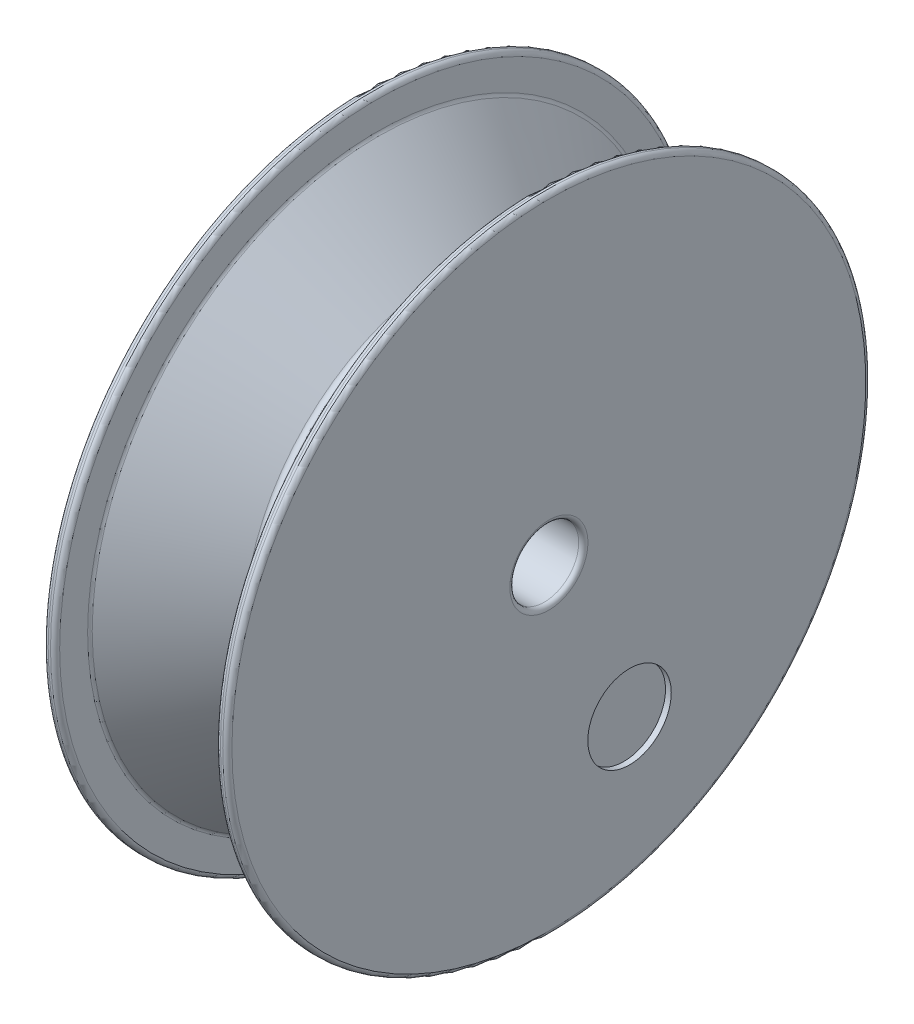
ISO-10303-21;
HEADER;
FILE_DESCRIPTION(('STEP AP214'),'2;1');
FILE_NAME('part.step','',(''),(''),'','','');
FILE_SCHEMA(('AUTOMOTIVE_DESIGN { 1 0 10303 214 1 1 1 1 }'));
ENDSEC;
DATA;
#1=APPLICATION_CONTEXT('core data for automotive mechanical design processes');
#2=APPLICATION_PROTOCOL_DEFINITION('international standard','automotive_design',2000,#1);
#3=PRODUCT_CONTEXT('',#1,'mechanical');
#4=PRODUCT('Part','Part','',(#3));
#5=PRODUCT_RELATED_PRODUCT_CATEGORY('part','',(#4));
#6=PRODUCT_DEFINITION_FORMATION('','',#4);
#7=PRODUCT_DEFINITION_CONTEXT('part definition',#1,'design');
#8=PRODUCT_DEFINITION('design','',#6,#7);
#9=PRODUCT_DEFINITION_SHAPE('','',#8);
#10=(LENGTH_UNIT() NAMED_UNIT(*) SI_UNIT(.MILLI.,.METRE.));
#11=(NAMED_UNIT(*) PLANE_ANGLE_UNIT() SI_UNIT($,.RADIAN.));
#12=(NAMED_UNIT(*) SI_UNIT($,.STERADIAN.) SOLID_ANGLE_UNIT());
#13=UNCERTAINTY_MEASURE_WITH_UNIT(LENGTH_MEASURE(1.E-05),#10,'distance_accuracy_value','');
#14=(GEOMETRIC_REPRESENTATION_CONTEXT(3) GLOBAL_UNCERTAINTY_ASSIGNED_CONTEXT((#13)) GLOBAL_UNIT_ASSIGNED_CONTEXT((#10,
#11,#12)) REPRESENTATION_CONTEXT('',''));
#15=CARTESIAN_POINT('',(0.,0.,0.));
#16=DIRECTION('',(0.,0.,1.));
#17=DIRECTION('',(1.,0.,0.));
#18=AXIS2_PLACEMENT_3D('',#15,#16,#17);
#19=CARTESIAN_POINT('',(0.,0.,0.));
#20=DIRECTION('',(-1.,0.,0.));
#21=DIRECTION('',(0.,0.,1.));
#22=AXIS2_PLACEMENT_3D('',#19,#20,#21);
#23=CYLINDRICAL_SURFACE('',#22,1.5);
#24=CARTESIAN_POINT('',(3.8,0.,0.));
#25=DIRECTION('',(-1.,0.,0.));
#26=DIRECTION('',(0.,0.,1.));
#27=AXIS2_PLACEMENT_3D('',#24,#25,#26);
#28=CIRCLE('',#27,1.5);
#29=CARTESIAN_POINT('',(3.8,0.,1.5));
#30=VERTEX_POINT('',#29);
#31=EDGE_CURVE('E40',#30,#30,#28,.F.);
#32=ORIENTED_EDGE('',*,*,#31,.T.);
#33=EDGE_LOOP('',(#32));
#34=FACE_BOUND('',#33,.T.);
#35=CARTESIAN_POINT('',(-3.8,0.,0.));
#36=DIRECTION('',(1.,0.,0.));
#37=DIRECTION('',(0.,0.,-1.));
#38=AXIS2_PLACEMENT_3D('',#35,#36,#37);
#39=CIRCLE('',#38,1.5);
#40=CARTESIAN_POINT('',(-3.8,0.,-1.5));
#41=VERTEX_POINT('',#40);
#42=EDGE_CURVE('E44',#41,#41,#39,.F.);
#43=ORIENTED_EDGE('',*,*,#42,.T.);
#44=EDGE_LOOP('',(#43));
#45=FACE_BOUND('',#44,.T.);
#46=ADVANCED_FACE('F29',(#34,#45),#23,.F.);
#47=CARTESIAN_POINT('',(-4.,1.5,0.));
#48=DIRECTION('',(1.,0.,0.));
#49=DIRECTION('',(0.,0.,-1.));
#50=AXIS2_PLACEMENT_3D('',#47,#48,#49);
#51=PLANE('',#50);
#52=CARTESIAN_POINT('',(-4.,0.,0.));
#53=DIRECTION('',(1.,0.,0.));
#54=DIRECTION('',(0.,0.,-1.));
#55=AXIS2_PLACEMENT_3D('',#52,#53,#54);
#56=CIRCLE('',#55,13.8);
#57=CARTESIAN_POINT('',(-4.,0.,-13.8));
#58=VERTEX_POINT('',#57);
#59=EDGE_CURVE('E10',#58,#58,#56,.F.);
#60=ORIENTED_EDGE('',*,*,#59,.T.);
#61=EDGE_LOOP('',(#60));
#62=FACE_BOUND('',#61,.T.);
#63=CARTESIAN_POINT('',(-4.,0.,0.));
#64=DIRECTION('',(1.,0.,0.));
#65=DIRECTION('',(0.,0.,-1.));
#66=AXIS2_PLACEMENT_3D('',#63,#64,#65);
#67=CIRCLE('',#66,1.7);
#68=CARTESIAN_POINT('',(-4.,0.,-1.7));
#69=VERTEX_POINT('',#68);
#70=EDGE_CURVE('E36',#69,#69,#67,.T.);
#71=ORIENTED_EDGE('',*,*,#70,.T.);
#72=EDGE_LOOP('',(#71));
#73=FACE_BOUND('',#72,.T.);
#74=ADVANCED_FACE('F135',(#62,#73),#51,.F.);
#75=CARTESIAN_POINT('',(0.,0.,0.));
#76=DIRECTION('',(-1.,0.,0.));
#77=DIRECTION('',(0.,0.,1.));
#78=AXIS2_PLACEMENT_3D('',#75,#76,#77);
#79=CYLINDRICAL_SURFACE('',#78,14.);
#80=CARTESIAN_POINT('',(-3.7,0.,0.));
#81=DIRECTION('',(-1.,0.,0.));
#82=DIRECTION('',(0.,0.,1.));
#83=AXIS2_PLACEMENT_3D('',#80,#81,#82);
#84=CIRCLE('',#83,14.);
#85=CARTESIAN_POINT('',(-3.7,0.,14.));
#86=VERTEX_POINT('',#85);
#87=EDGE_CURVE('E55',#86,#86,#84,.T.);
#88=ORIENTED_EDGE('',*,*,#87,.T.);
#89=EDGE_LOOP('',(#88));
#90=FACE_BOUND('',#89,.T.);
#91=CARTESIAN_POINT('',(-3.8,0.,0.));
#92=DIRECTION('',(1.,0.,0.));
#93=DIRECTION('',(0.,0.,-1.));
#94=AXIS2_PLACEMENT_3D('',#91,#92,#93);
#95=CIRCLE('',#94,14.);
#96=CARTESIAN_POINT('',(-3.8,0.,-14.));
#97=VERTEX_POINT('',#96);
#98=EDGE_CURVE('E58',#97,#97,#95,.T.);
#99=ORIENTED_EDGE('',*,*,#98,.T.);
#100=EDGE_LOOP('',(#99));
#101=FACE_BOUND('',#100,.T.);
#102=ADVANCED_FACE('F141',(#90,#101),#79,.T.);
#103=CARTESIAN_POINT('',(-3.5,14.,0.));
#104=DIRECTION('',(-1.,0.,0.));
#105=DIRECTION('',(0.,0.,1.));
#106=AXIS2_PLACEMENT_3D('',#103,#104,#105);
#107=PLANE('',#106);
#108=CARTESIAN_POINT('',(-3.5,0.,0.));
#109=DIRECTION('',(-1.,0.,0.));
#110=DIRECTION('',(0.,0.,1.));
#111=AXIS2_PLACEMENT_3D('',#108,#109,#110);
#112=CIRCLE('',#111,12.5828427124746);
#113=CARTESIAN_POINT('',(-3.5,0.,12.5828427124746));
#114=VERTEX_POINT('',#113);
#115=EDGE_CURVE('E61',#114,#114,#112,.T.);
#116=ORIENTED_EDGE('',*,*,#115,.T.);
#117=EDGE_LOOP('',(#116));
#118=FACE_BOUND('',#117,.T.);
#119=CARTESIAN_POINT('',(-3.5,0.,0.));
#120=DIRECTION('',(-1.,0.,0.));
#121=DIRECTION('',(0.,0.,1.));
#122=AXIS2_PLACEMENT_3D('',#119,#120,#121);
#123=CIRCLE('',#122,13.8);
#124=CARTESIAN_POINT('',(-3.5,0.,13.8));
#125=VERTEX_POINT('',#124);
#126=EDGE_CURVE('E64',#125,#125,#123,.F.);
#127=ORIENTED_EDGE('',*,*,#126,.T.);
#128=EDGE_LOOP('',(#127));
#129=FACE_BOUND('',#128,.T.);
#130=ADVANCED_FACE('F177',(#118,#129),#107,.F.);
#131=CARTESIAN_POINT('',(0.,0.,0.));
#132=DIRECTION('',(-1.,0.,0.));
#133=DIRECTION('',(0.,0.,1.));
#134=AXIS2_PLACEMENT_3D('',#131,#132,#133);
#135=CONICAL_SURFACE('',#134,8.99999999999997,0.785398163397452);
#136=CARTESIAN_POINT('',(-0.141421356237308,0.,0.));
#137=DIRECTION('',(-1.,0.,0.));
#138=DIRECTION('',(0.,0.,1.));
#139=AXIS2_PLACEMENT_3D('',#136,#137,#138);
#140=CIRCLE('',#139,9.14142135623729);
#141=CARTESIAN_POINT('',(-0.141421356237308,0.,9.14142135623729));
#142=VERTEX_POINT('',#141);
#143=EDGE_CURVE('E67',#142,#142,#140,.T.);
#144=ORIENTED_EDGE('',*,*,#143,.T.);
#145=EDGE_LOOP('',(#144));
#146=FACE_BOUND('',#145,.T.);
#147=CARTESIAN_POINT('',(-3.44142135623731,0.,0.));
#148=DIRECTION('',(-1.,0.,0.));
#149=DIRECTION('',(0.,0.,1.));
#150=AXIS2_PLACEMENT_3D('',#147,#148,#149);
#151=CIRCLE('',#150,12.4414213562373);
#152=CARTESIAN_POINT('',(-3.44142135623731,0.,12.4414213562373));
#153=VERTEX_POINT('',#152);
#154=EDGE_CURVE('E70',#153,#153,#151,.F.);
#155=ORIENTED_EDGE('',*,*,#154,.T.);
#156=EDGE_LOOP('',(#155));
#157=FACE_BOUND('',#156,.T.);
#158=ADVANCED_FACE('F182',(#146,#157),#135,.T.);
#159=CARTESIAN_POINT('',(3.5,0.,0.));
#160=DIRECTION('',(1.,0.,0.));
#161=DIRECTION('',(0.,0.,-1.));
#162=AXIS2_PLACEMENT_3D('',#159,#160,#161);
#163=CONICAL_SURFACE('',#162,12.5,0.785398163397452);
#164=CARTESIAN_POINT('',(3.4414213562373,0.,0.));
#165=DIRECTION('',(1.,0.,0.));
#166=DIRECTION('',(0.,0.,-1.));
#167=AXIS2_PLACEMENT_3D('',#164,#165,#166);
#168=CIRCLE('',#167,12.4414213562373);
#169=CARTESIAN_POINT('',(3.4414213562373,0.,-12.4414213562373));
#170=VERTEX_POINT('',#169);
#171=EDGE_CURVE('E73',#170,#170,#168,.F.);
#172=ORIENTED_EDGE('',*,*,#171,.T.);
#173=EDGE_LOOP('',(#172));
#174=FACE_BOUND('',#173,.T.);
#175=CARTESIAN_POINT('',(0.141421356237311,0.,0.));
#176=DIRECTION('',(1.,0.,0.));
#177=DIRECTION('',(0.,0.,-1.));
#178=AXIS2_PLACEMENT_3D('',#175,#176,#177);
#179=CIRCLE('',#178,9.14142135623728);
#180=CARTESIAN_POINT('',(0.141421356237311,0.,-9.14142135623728));
#181=VERTEX_POINT('',#180);
#182=EDGE_CURVE('E76',#181,#181,#179,.T.);
#183=ORIENTED_EDGE('',*,*,#182,.T.);
#184=EDGE_LOOP('',(#183));
#185=FACE_BOUND('',#184,.T.);
#186=ADVANCED_FACE('F131',(#174,#185),#163,.T.);
#187=CARTESIAN_POINT('',(3.49999999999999,12.5,0.));
#188=DIRECTION('',(1.,0.,0.));
#189=DIRECTION('',(0.,0.,-1.));
#190=AXIS2_PLACEMENT_3D('',#187,#188,#189);
#191=PLANE('',#190);
#192=CARTESIAN_POINT('',(3.49999999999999,0.,0.));
#193=DIRECTION('',(1.,0.,0.));
#194=DIRECTION('',(0.,0.,-1.));
#195=AXIS2_PLACEMENT_3D('',#192,#193,#194);
#196=CIRCLE('',#195,13.8);
#197=CARTESIAN_POINT('',(3.49999999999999,0.,-13.8));
#198=VERTEX_POINT('',#197);
#199=EDGE_CURVE('E85',#198,#198,#196,.F.);
#200=ORIENTED_EDGE('',*,*,#199,.T.);
#201=EDGE_LOOP('',(#200));
#202=FACE_BOUND('',#201,.T.);
#203=CARTESIAN_POINT('',(3.49999999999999,0.,0.));
#204=DIRECTION('',(1.,0.,0.));
#205=DIRECTION('',(0.,0.,-1.));
#206=AXIS2_PLACEMENT_3D('',#203,#204,#205);
#207=CIRCLE('',#206,12.5828427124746);
#208=CARTESIAN_POINT('',(3.49999999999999,0.,-12.5828427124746));
#209=VERTEX_POINT('',#208);
#210=EDGE_CURVE('E88',#209,#209,#207,.T.);
#211=ORIENTED_EDGE('',*,*,#210,.T.);
#212=EDGE_LOOP('',(#211));
#213=FACE_BOUND('',#212,.T.);
#214=ADVANCED_FACE('F125',(#202,#213),#191,.F.);
#215=CARTESIAN_POINT('',(0.,0.,0.));
#216=DIRECTION('',(-1.,0.,0.));
#217=DIRECTION('',(0.,0.,1.));
#218=AXIS2_PLACEMENT_3D('',#215,#216,#217);
#219=CYLINDRICAL_SURFACE('',#218,14.);
#220=CARTESIAN_POINT('',(3.69999999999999,0.,0.));
#221=DIRECTION('',(1.,0.,0.));
#222=DIRECTION('',(0.,0.,-1.));
#223=AXIS2_PLACEMENT_3D('',#220,#221,#222);
#224=CIRCLE('',#223,14.);
#225=CARTESIAN_POINT('',(3.69999999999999,0.,-14.));
#226=VERTEX_POINT('',#225);
#227=EDGE_CURVE('E79',#226,#226,#224,.T.);
#228=ORIENTED_EDGE('',*,*,#227,.T.);
#229=EDGE_LOOP('',(#228));
#230=FACE_BOUND('',#229,.T.);
#231=CARTESIAN_POINT('',(3.8,0.,0.));
#232=DIRECTION('',(-1.,0.,0.));
#233=DIRECTION('',(0.,0.,1.));
#234=AXIS2_PLACEMENT_3D('',#231,#232,#233);
#235=CIRCLE('',#234,14.);
#236=CARTESIAN_POINT('',(3.8,0.,14.));
#237=VERTEX_POINT('',#236);
#238=EDGE_CURVE('E82',#237,#237,#235,.T.);
#239=ORIENTED_EDGE('',*,*,#238,.T.);
#240=EDGE_LOOP('',(#239));
#241=FACE_BOUND('',#240,.T.);
#242=ADVANCED_FACE('F110',(#230,#241),#219,.T.);
#243=CARTESIAN_POINT('',(4.,1.5,0.));
#244=DIRECTION('',(-1.,0.,0.));
#245=DIRECTION('',(0.,0.,1.));
#246=AXIS2_PLACEMENT_3D('',#243,#244,#245);
#247=PLANE('',#246);
#248=CARTESIAN_POINT('',(4.,-7.47256814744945,-3.51192559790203));
#249=DIRECTION('',(1.,0.,0.));
#250=DIRECTION('',(0.,0.,-1.));
#251=AXIS2_PLACEMENT_3D('',#248,#249,#250);
#252=CIRCLE('',#251,1.81728081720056);
#253=CARTESIAN_POINT('',(4.,-7.47256814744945,-5.32920641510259));
#254=VERTEX_POINT('',#253);
#255=EDGE_CURVE('E92',#254,#254,#252,.T.);
#256=ORIENTED_EDGE('',*,*,#255,.F.);
#257=EDGE_LOOP('',(#256));
#258=FACE_BOUND('',#257,.T.);
#259=CARTESIAN_POINT('',(4.,0.,0.));
#260=DIRECTION('',(-1.,0.,0.));
#261=DIRECTION('',(0.,0.,1.));
#262=AXIS2_PLACEMENT_3D('',#259,#260,#261);
#263=CIRCLE('',#262,1.7);
#264=CARTESIAN_POINT('',(4.,0.,1.7));
#265=VERTEX_POINT('',#264);
#266=EDGE_CURVE('E49',#265,#265,#263,.T.);
#267=ORIENTED_EDGE('',*,*,#266,.T.);
#268=EDGE_LOOP('',(#267));
#269=FACE_BOUND('',#268,.T.);
#270=CARTESIAN_POINT('',(4.,0.,0.));
#271=DIRECTION('',(-1.,0.,0.));
#272=DIRECTION('',(0.,0.,1.));
#273=AXIS2_PLACEMENT_3D('',#270,#271,#272);
#274=CIRCLE('',#273,13.8);
#275=CARTESIAN_POINT('',(4.,0.,13.8));
#276=VERTEX_POINT('',#275);
#277=EDGE_CURVE('E52',#276,#276,#274,.F.);
#278=ORIENTED_EDGE('',*,*,#277,.T.);
#279=EDGE_LOOP('',(#278));
#280=FACE_BOUND('',#279,.T.);
#281=ADVANCED_FACE('F106',(#258,#269,#280),#247,.F.);
#282=CARTESIAN_POINT('',(3.69999999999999,0.,0.));
#283=DIRECTION('',(1.,0.,0.));
#284=DIRECTION('',(0.,0.,-1.));
#285=AXIS2_PLACEMENT_3D('',#282,#283,#284);
#286=TOROIDAL_SURFACE('',#285,13.8,0.2);
#287=ORIENTED_EDGE('',*,*,#227,.F.);
#288=EDGE_LOOP('',(#287));
#289=FACE_BOUND('',#288,.T.);
#290=ORIENTED_EDGE('',*,*,#199,.F.);
#291=EDGE_LOOP('',(#290));
#292=FACE_BOUND('',#291,.T.);
#293=ADVANCED_FACE('F109',(#289,#292),#286,.T.);
#294=CARTESIAN_POINT('',(3.29999999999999,0.,0.));
#295=DIRECTION('',(1.,0.,0.));
#296=DIRECTION('',(0.,0.,-1.));
#297=AXIS2_PLACEMENT_3D('',#294,#295,#296);
#298=TOROIDAL_SURFACE('',#297,12.5828427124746,0.2);
#299=ORIENTED_EDGE('',*,*,#210,.F.);
#300=EDGE_LOOP('',(#299));
#301=FACE_BOUND('',#300,.T.);
#302=ORIENTED_EDGE('',*,*,#171,.F.);
#303=EDGE_LOOP('',(#302));
#304=FACE_BOUND('',#303,.T.);
#305=ADVANCED_FACE('F148',(#301,#304),#298,.F.);
#306=CARTESIAN_POINT('',(0.,0.,0.));
#307=DIRECTION('',(-1.,0.,0.));
#308=DIRECTION('',(0.,0.,1.));
#309=AXIS2_PLACEMENT_3D('',#306,#307,#308);
#310=TOROIDAL_SURFACE('',#309,9.28284271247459,0.2);
#311=ORIENTED_EDGE('',*,*,#182,.F.);
#312=EDGE_LOOP('',(#311));
#313=FACE_BOUND('',#312,.T.);
#314=ORIENTED_EDGE('',*,*,#143,.F.);
#315=EDGE_LOOP('',(#314));
#316=FACE_BOUND('',#315,.T.);
#317=ADVANCED_FACE('F152',(#313,#316),#310,.F.);
#318=CARTESIAN_POINT('',(-3.3,0.,0.));
#319=DIRECTION('',(-1.,0.,0.));
#320=DIRECTION('',(0.,0.,1.));
#321=AXIS2_PLACEMENT_3D('',#318,#319,#320);
#322=TOROIDAL_SURFACE('',#321,12.5828427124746,0.2);
#323=ORIENTED_EDGE('',*,*,#154,.F.);
#324=EDGE_LOOP('',(#323));
#325=FACE_BOUND('',#324,.T.);
#326=ORIENTED_EDGE('',*,*,#115,.F.);
#327=EDGE_LOOP('',(#326));
#328=FACE_BOUND('',#327,.T.);
#329=ADVANCED_FACE('F156',(#325,#328),#322,.F.);
#330=CARTESIAN_POINT('',(-3.7,0.,0.));
#331=DIRECTION('',(-1.,0.,0.));
#332=DIRECTION('',(0.,0.,1.));
#333=AXIS2_PLACEMENT_3D('',#330,#331,#332);
#334=TOROIDAL_SURFACE('',#333,13.8,0.2);
#335=ORIENTED_EDGE('',*,*,#126,.F.);
#336=EDGE_LOOP('',(#335));
#337=FACE_BOUND('',#336,.T.);
#338=ORIENTED_EDGE('',*,*,#87,.F.);
#339=EDGE_LOOP('',(#338));
#340=FACE_BOUND('',#339,.T.);
#341=ADVANCED_FACE('F160',(#337,#340),#334,.T.);
#342=CARTESIAN_POINT('',(3.8,0.,0.));
#343=DIRECTION('',(-1.,0.,0.));
#344=DIRECTION('',(0.,0.,1.));
#345=AXIS2_PLACEMENT_3D('',#342,#343,#344);
#346=TOROIDAL_SURFACE('',#345,1.7,0.2);
#347=ORIENTED_EDGE('',*,*,#31,.F.);
#348=EDGE_LOOP('',(#347));
#349=FACE_BOUND('',#348,.T.);
#350=ORIENTED_EDGE('',*,*,#266,.F.);
#351=EDGE_LOOP('',(#350));
#352=FACE_BOUND('',#351,.T.);
#353=ADVANCED_FACE('F120',(#349,#352),#346,.T.);
#354=CARTESIAN_POINT('',(3.8,0.,0.));
#355=DIRECTION('',(-1.,0.,0.));
#356=DIRECTION('',(0.,0.,1.));
#357=AXIS2_PLACEMENT_3D('',#354,#355,#356);
#358=TOROIDAL_SURFACE('',#357,13.8,0.2);
#359=ORIENTED_EDGE('',*,*,#277,.F.);
#360=EDGE_LOOP('',(#359));
#361=FACE_BOUND('',#360,.T.);
#362=ORIENTED_EDGE('',*,*,#238,.F.);
#363=EDGE_LOOP('',(#362));
#364=FACE_BOUND('',#363,.T.);
#365=ADVANCED_FACE('F116',(#361,#364),#358,.T.);
#366=CARTESIAN_POINT('',(-3.8,0.,0.));
#367=DIRECTION('',(1.,0.,0.));
#368=DIRECTION('',(0.,0.,-1.));
#369=AXIS2_PLACEMENT_3D('',#366,#367,#368);
#370=TOROIDAL_SURFACE('',#369,13.8,0.2);
#371=ORIENTED_EDGE('',*,*,#98,.F.);
#372=EDGE_LOOP('',(#371));
#373=FACE_BOUND('',#372,.T.);
#374=ORIENTED_EDGE('',*,*,#59,.F.);
#375=EDGE_LOOP('',(#374));
#376=FACE_BOUND('',#375,.T.);
#377=ADVANCED_FACE('F119',(#373,#376),#370,.T.);
#378=CARTESIAN_POINT('',(-3.8,0.,0.));
#379=DIRECTION('',(1.,0.,0.));
#380=DIRECTION('',(0.,0.,-1.));
#381=AXIS2_PLACEMENT_3D('',#378,#379,#380);
#382=TOROIDAL_SURFACE('',#381,1.7,0.2);
#383=ORIENTED_EDGE('',*,*,#70,.F.);
#384=EDGE_LOOP('',(#383));
#385=FACE_BOUND('',#384,.T.);
#386=ORIENTED_EDGE('',*,*,#42,.F.);
#387=EDGE_LOOP('',(#386));
#388=FACE_BOUND('',#387,.T.);
#389=ADVANCED_FACE('F31',(#385,#388),#382,.T.);
#390=CARTESIAN_POINT('',(3.75,-7.47256814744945,-3.51192559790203));
#391=DIRECTION('',(1.,0.,0.));
#392=DIRECTION('',(0.,0.,-1.));
#393=AXIS2_PLACEMENT_3D('',#390,#391,#392);
#394=CYLINDRICAL_SURFACE('',#393,1.81728081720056);
#395=CARTESIAN_POINT('',(3.75,-7.47256814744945,-3.51192559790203));
#396=DIRECTION('',(1.,0.,0.));
#397=DIRECTION('',(0.,0.,-1.));
#398=AXIS2_PLACEMENT_3D('',#395,#396,#397);
#399=CIRCLE('',#398,1.81728081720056);
#400=CARTESIAN_POINT('',(3.75,-7.47256814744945,-5.32920641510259));
#401=VERTEX_POINT('',#400);
#402=EDGE_CURVE('E91',#401,#401,#399,.T.);
#403=ORIENTED_EDGE('',*,*,#402,.F.);
#404=EDGE_LOOP('',(#403));
#405=FACE_BOUND('',#404,.T.);
#406=ORIENTED_EDGE('',*,*,#255,.T.);
#407=EDGE_LOOP('',(#406));
#408=FACE_BOUND('',#407,.T.);
#409=ADVANCED_FACE('F100',(#405,#408),#394,.F.);
#410=CARTESIAN_POINT('',(3.75,-7.47256814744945,-3.51192559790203));
#411=DIRECTION('',(1.,0.,0.));
#412=DIRECTION('',(0.,0.,-1.));
#413=AXIS2_PLACEMENT_3D('',#410,#411,#412);
#414=PLANE('',#413);
#415=ORIENTED_EDGE('',*,*,#402,.T.);
#416=EDGE_LOOP('',(#415));
#417=FACE_BOUND('',#416,.T.);
#418=ADVANCED_FACE('F98',(#417),#414,.T.);
#419=CLOSED_SHELL('',(#46,#74,#102,#130,#158,#186,#214,#242,#281,#293,#305,#317,#329,#341,#353,
#365,#377,#389,#409,#418));
#420=MANIFOLD_SOLID_BREP('B2',#419);
#421=ADVANCED_BREP_SHAPE_REPRESENTATION('',(#18,#420),#14);
#422=SHAPE_DEFINITION_REPRESENTATION(#9,#421);
ENDSEC;
END-ISO-10303-21;
